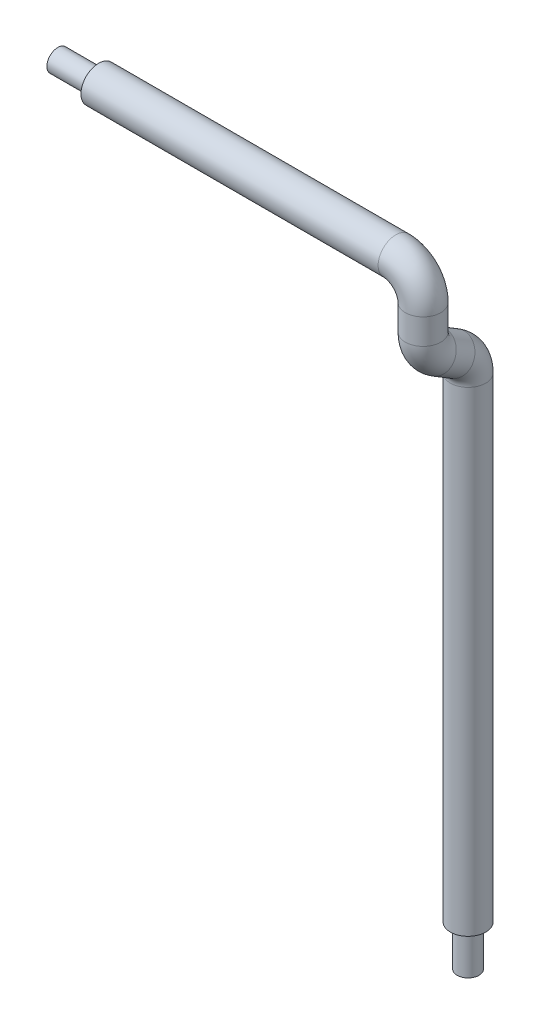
ISO-10303-21;
HEADER;
FILE_DESCRIPTION(('STEP AP214'),'2;1');
FILE_NAME('part.step','',(''),(''),'','','');
FILE_SCHEMA(('AUTOMOTIVE_DESIGN { 1 0 10303 214 1 1 1 1 }'));
ENDSEC;
DATA;
#1=APPLICATION_CONTEXT('core data for automotive mechanical design processes');
#2=APPLICATION_PROTOCOL_DEFINITION('international standard','automotive_design',2000,#1);
#3=PRODUCT_CONTEXT('',#1,'mechanical');
#4=PRODUCT('Part','Part','',(#3));
#5=PRODUCT_RELATED_PRODUCT_CATEGORY('part','',(#4));
#6=PRODUCT_DEFINITION_FORMATION('','',#4);
#7=PRODUCT_DEFINITION_CONTEXT('part definition',#1,'design');
#8=PRODUCT_DEFINITION('design','',#6,#7);
#9=PRODUCT_DEFINITION_SHAPE('','',#8);
#10=(LENGTH_UNIT() NAMED_UNIT(*) SI_UNIT(.MILLI.,.METRE.));
#11=(NAMED_UNIT(*) PLANE_ANGLE_UNIT() SI_UNIT($,.RADIAN.));
#12=(NAMED_UNIT(*) SI_UNIT($,.STERADIAN.) SOLID_ANGLE_UNIT());
#13=UNCERTAINTY_MEASURE_WITH_UNIT(LENGTH_MEASURE(1.E-05),#10,'distance_accuracy_value','');
#14=(GEOMETRIC_REPRESENTATION_CONTEXT(3) GLOBAL_UNCERTAINTY_ASSIGNED_CONTEXT((#13)) GLOBAL_UNIT_ASSIGNED_CONTEXT((#10,
#11,#12)) REPRESENTATION_CONTEXT('',''));
#15=CARTESIAN_POINT('',(0.,0.,0.));
#16=DIRECTION('',(0.,0.,1.));
#17=DIRECTION('',(1.,0.,0.));
#18=AXIS2_PLACEMENT_3D('',#15,#16,#17);
#19=CARTESIAN_POINT('',(-8.,-8.,-17.25));
#20=DIRECTION('',(1.,0.,0.));
#21=DIRECTION('',(0.,0.,-1.));
#22=AXIS2_PLACEMENT_3D('',#19,#20,#21);
#23=PLANE('',#22);
#24=CARTESIAN_POINT('',(-8.,-8.,-17.25));
#25=DIRECTION('',(-1.,0.,0.));
#26=DIRECTION('',(0.,0.,1.));
#27=AXIS2_PLACEMENT_3D('',#24,#25,#26);
#28=CIRCLE('',#27,0.4);
#29=CARTESIAN_POINT('',(-8.,-8.,-16.85));
#30=VERTEX_POINT('',#29);
#31=EDGE_CURVE('E18',#30,#30,#28,.F.);
#32=ORIENTED_EDGE('',*,*,#31,.F.);
#33=EDGE_LOOP('',(#32));
#34=FACE_BOUND('',#33,.T.);
#35=ADVANCED_FACE('F15',(#34),#23,.F.);
#36=CARTESIAN_POINT('',(-8.,-8.,-17.25));
#37=DIRECTION('',(-1.,0.,0.));
#38=DIRECTION('',(0.,0.,1.));
#39=AXIS2_PLACEMENT_3D('',#36,#37,#38);
#40=CYLINDRICAL_SURFACE('',#39,0.4);
#41=CARTESIAN_POINT('',(-6.5,-8.,-17.25));
#42=DIRECTION('',(-1.,0.,0.));
#43=DIRECTION('',(0.,0.,1.));
#44=AXIS2_PLACEMENT_3D('',#41,#42,#43);
#45=CIRCLE('',#44,0.4);
#46=CARTESIAN_POINT('',(-6.5,-8.,-16.85));
#47=VERTEX_POINT('',#46);
#48=EDGE_CURVE('E43',#47,#47,#45,.F.);
#49=ORIENTED_EDGE('',*,*,#48,.F.);
#50=EDGE_LOOP('',(#49));
#51=FACE_BOUND('',#50,.T.);
#52=ORIENTED_EDGE('',*,*,#31,.T.);
#53=EDGE_LOOP('',(#52));
#54=FACE_BOUND('',#53,.T.);
#55=ADVANCED_FACE('F50',(#51,#54),#40,.T.);
#56=CARTESIAN_POINT('',(-6.5,0.,0.));
#57=DIRECTION('',(-1.,0.,0.));
#58=DIRECTION('',(0.,0.,1.));
#59=AXIS2_PLACEMENT_3D('',#56,#57,#58);
#60=PLANE('',#59);
#61=ORIENTED_EDGE('',*,*,#48,.T.);
#62=EDGE_LOOP('',(#61));
#63=FACE_BOUND('',#62,.T.);
#64=CARTESIAN_POINT('',(-6.5,-8.,-17.25));
#65=DIRECTION('',(1.,0.,0.));
#66=DIRECTION('',(0.,0.,-1.));
#67=AXIS2_PLACEMENT_3D('',#64,#65,#66);
#68=CIRCLE('',#67,0.65);
#69=CARTESIAN_POINT('',(-6.5,-8.,-17.9));
#70=VERTEX_POINT('',#69);
#71=EDGE_CURVE('E40',#70,#70,#68,.T.);
#72=ORIENTED_EDGE('',*,*,#71,.F.);
#73=EDGE_LOOP('',(#72));
#74=FACE_BOUND('',#73,.T.);
#75=ADVANCED_FACE('F57',(#63,#74),#60,.T.);
#76=CARTESIAN_POINT('',(-8.,-8.,-17.25));
#77=DIRECTION('',(1.,0.,0.));
#78=DIRECTION('',(0.,0.,-1.));
#79=AXIS2_PLACEMENT_3D('',#76,#77,#78);
#80=CYLINDRICAL_SURFACE('',#79,0.65);
#81=CARTESIAN_POINT('',(4.4,-8.,-17.25));
#82=DIRECTION('',(1.,0.,0.));
#83=DIRECTION('',(0.,1.,0.));
#84=AXIS2_PLACEMENT_3D('',#81,#82,#83);
#85=CIRCLE('',#84,0.65);
#86=CARTESIAN_POINT('',(4.4,-7.35,-17.25));
#87=VERTEX_POINT('',#86);
#88=EDGE_CURVE('E42',#87,#87,#85,.T.);
#89=ORIENTED_EDGE('',*,*,#88,.F.);
#90=EDGE_LOOP('',(#89));
#91=FACE_BOUND('',#90,.T.);
#92=ORIENTED_EDGE('',*,*,#71,.T.);
#93=EDGE_LOOP('',(#92));
#94=FACE_BOUND('',#93,.T.);
#95=ADVANCED_FACE('F99',(#91,#94),#80,.T.);
#96=CARTESIAN_POINT('',(4.4,-9.,-17.25));
#97=DIRECTION('',(0.,0.,-1.));
#98=DIRECTION('',(0.,-1.,0.));
#99=AXIS2_PLACEMENT_3D('',#96,#97,#98);
#100=TOROIDAL_SURFACE('',#99,1.,0.65);
#101=CARTESIAN_POINT('',(5.4,-9.,-17.25));
#102=DIRECTION('',(0.,-1.,0.));
#103=DIRECTION('',(0.,0.,-1.));
#104=AXIS2_PLACEMENT_3D('',#101,#102,#103);
#105=CIRCLE('',#104,0.65);
#106=CARTESIAN_POINT('',(5.4,-9.,-17.9));
#107=VERTEX_POINT('',#106);
#108=EDGE_CURVE('E31',#107,#107,#105,.T.);
#109=ORIENTED_EDGE('',*,*,#108,.F.);
#110=EDGE_LOOP('',(#109));
#111=FACE_BOUND('',#110,.T.);
#112=ORIENTED_EDGE('',*,*,#88,.T.);
#113=EDGE_LOOP('',(#112));
#114=FACE_BOUND('',#113,.T.);
#115=ADVANCED_FACE('F94',(#111,#114),#100,.T.);
#116=CARTESIAN_POINT('',(5.4,-9.,-17.25));
#117=DIRECTION('',(0.,-1.,0.));
#118=DIRECTION('',(0.,0.,-1.));
#119=AXIS2_PLACEMENT_3D('',#116,#117,#118);
#120=CYLINDRICAL_SURFACE('',#119,0.65);
#121=CARTESIAN_POINT('',(5.4,-9.936740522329,-17.25));
#122=DIRECTION('',(0.,-1.,0.));
#123=DIRECTION('',(0.,0.,1.));
#124=AXIS2_PLACEMENT_3D('',#121,#122,#123);
#125=CIRCLE('',#124,0.65);
#126=CARTESIAN_POINT('',(5.4,-9.936740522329,-16.6));
#127=VERTEX_POINT('',#126);
#128=EDGE_CURVE('E103',#127,#127,#125,.T.);
#129=ORIENTED_EDGE('',*,*,#128,.F.);
#130=EDGE_LOOP('',(#129));
#131=FACE_BOUND('',#130,.T.);
#132=ORIENTED_EDGE('',*,*,#108,.T.);
#133=EDGE_LOOP('',(#132));
#134=FACE_BOUND('',#133,.T.);
#135=ADVANCED_FACE('F90',(#131,#134),#120,.T.);
#136=CARTESIAN_POINT('',(5.4,-9.936740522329,-18.25));
#137=DIRECTION('',(1.,0.,0.));
#138=DIRECTION('',(0.,0.,-1.));
#139=AXIS2_PLACEMENT_3D('',#136,#137,#138);
#140=TOROIDAL_SURFACE('',#139,1.,0.65);
#141=CARTESIAN_POINT('',(5.4,-10.7919383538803,-17.7316982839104));
#142=DIRECTION('',(0.,-0.51830171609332,-0.855197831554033));
#143=DIRECTION('',(0.,0.855197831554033,-0.51830171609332));
#144=AXIS2_PLACEMENT_3D('',#141,#142,#143);
#145=CIRCLE('',#144,0.65);
#146=CARTESIAN_POINT('',(5.4,-10.2360597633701,-18.0685943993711));
#147=VERTEX_POINT('',#146);
#148=EDGE_CURVE('E39',#147,#147,#145,.T.);
#149=ORIENTED_EDGE('',*,*,#148,.F.);
#150=EDGE_LOOP('',(#149));
#151=FACE_BOUND('',#150,.T.);
#152=ORIENTED_EDGE('',*,*,#128,.T.);
#153=EDGE_LOOP('',(#152));
#154=FACE_BOUND('',#153,.T.);
#155=ADVANCED_FACE('F85',(#151,#154),#140,.T.);
#156=CARTESIAN_POINT('',(5.4,-31.,-18.9));
#157=DIRECTION('',(0.,-1.,0.));
#158=DIRECTION('',(0.,0.,-1.));
#159=AXIS2_PLACEMENT_3D('',#156,#157,#158);
#160=PLANE('',#159);
#161=CARTESIAN_POINT('',(5.4,-31.,-18.9));
#162=DIRECTION('',(0.,-1.,0.));
#163=DIRECTION('',(0.,0.,-1.));
#164=AXIS2_PLACEMENT_3D('',#161,#162,#163);
#165=CIRCLE('',#164,0.4);
#166=CARTESIAN_POINT('',(5.4,-31.,-19.3));
#167=VERTEX_POINT('',#166);
#168=EDGE_CURVE('E36',#167,#167,#165,.F.);
#169=ORIENTED_EDGE('',*,*,#168,.F.);
#170=EDGE_LOOP('',(#169));
#171=FACE_BOUND('',#170,.T.);
#172=ADVANCED_FACE('F89',(#171),#160,.T.);
#173=CARTESIAN_POINT('',(5.4,-10.79193835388,-17.73169828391));
#174=DIRECTION('',(0.,-0.51830171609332,-0.855197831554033));
#175=DIRECTION('',(0.,0.855197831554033,-0.51830171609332));
#176=AXIS2_PLACEMENT_3D('',#173,#174,#175);
#177=CYLINDRICAL_SURFACE('',#176,0.65);
#178=CARTESIAN_POINT('',(5.4,-11.2080616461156,-18.4183017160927));
#179=DIRECTION('',(0.,-0.518301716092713,-0.8551978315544));
#180=DIRECTION('',(0.,0.8551978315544,-0.518301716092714));
#181=AXIS2_PLACEMENT_3D('',#178,#179,#180);
#182=CIRCLE('',#181,0.65);
#183=CARTESIAN_POINT('',(5.4,-10.6521830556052,-18.755197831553));
#184=VERTEX_POINT('',#183);
#185=EDGE_CURVE('E35',#184,#184,#182,.T.);
#186=ORIENTED_EDGE('',*,*,#185,.F.);
#187=EDGE_LOOP('',(#186));
#188=FACE_BOUND('',#187,.T.);
#189=ORIENTED_EDGE('',*,*,#148,.T.);
#190=EDGE_LOOP('',(#189));
#191=FACE_BOUND('',#190,.T.);
#192=ADVANCED_FACE('F116',(#188,#191),#177,.T.);
#193=CARTESIAN_POINT('',(5.4,-21.,-18.9));
#194=DIRECTION('',(0.,-1.,0.));
#195=DIRECTION('',(0.,0.,-1.));
#196=AXIS2_PLACEMENT_3D('',#193,#194,#195);
#197=CYLINDRICAL_SURFACE('',#196,0.4);
#198=CARTESIAN_POINT('',(5.4,-29.5,-18.9));
#199=DIRECTION('',(0.,-1.,0.));
#200=DIRECTION('',(0.,0.,-1.));
#201=AXIS2_PLACEMENT_3D('',#198,#199,#200);
#202=CIRCLE('',#201,0.4);
#203=CARTESIAN_POINT('',(5.4,-29.5,-19.3));
#204=VERTEX_POINT('',#203);
#205=EDGE_CURVE('E27',#204,#204,#202,.F.);
#206=ORIENTED_EDGE('',*,*,#205,.F.);
#207=EDGE_LOOP('',(#206));
#208=FACE_BOUND('',#207,.T.);
#209=ORIENTED_EDGE('',*,*,#168,.T.);
#210=EDGE_LOOP('',(#209));
#211=FACE_BOUND('',#210,.T.);
#212=ADVANCED_FACE('F74',(#208,#211),#197,.T.);
#213=CARTESIAN_POINT('',(5.4,-12.06325947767,-17.9));
#214=DIRECTION('',(-1.,0.,0.));
#215=DIRECTION('',(0.,-0.855197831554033,0.518301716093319));
#216=AXIS2_PLACEMENT_3D('',#213,#214,#215);
#217=TOROIDAL_SURFACE('',#216,0.999999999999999,0.65);
#218=CARTESIAN_POINT('',(5.4,-12.06325947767,-18.9));
#219=DIRECTION('',(0.,-1.,0.));
#220=DIRECTION('',(0.,0.,-1.));
#221=AXIS2_PLACEMENT_3D('',#218,#219,#220);
#222=CIRCLE('',#221,0.65);
#223=CARTESIAN_POINT('',(5.4,-12.06325947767,-19.55));
#224=VERTEX_POINT('',#223);
#225=EDGE_CURVE('E22',#224,#224,#222,.T.);
#226=ORIENTED_EDGE('',*,*,#225,.F.);
#227=EDGE_LOOP('',(#226));
#228=FACE_BOUND('',#227,.T.);
#229=ORIENTED_EDGE('',*,*,#185,.T.);
#230=EDGE_LOOP('',(#229));
#231=FACE_BOUND('',#230,.T.);
#232=ADVANCED_FACE('F67',(#228,#231),#217,.T.);
#233=CARTESIAN_POINT('',(0.,-29.5,0.));
#234=DIRECTION('',(0.,-1.,0.));
#235=DIRECTION('',(0.,0.,-1.));
#236=AXIS2_PLACEMENT_3D('',#233,#234,#235);
#237=PLANE('',#236);
#238=ORIENTED_EDGE('',*,*,#205,.T.);
#239=EDGE_LOOP('',(#238));
#240=FACE_BOUND('',#239,.T.);
#241=CARTESIAN_POINT('',(5.4,-29.5,-18.9));
#242=DIRECTION('',(0.,-1.,0.));
#243=DIRECTION('',(0.,0.,-1.));
#244=AXIS2_PLACEMENT_3D('',#241,#242,#243);
#245=CIRCLE('',#244,0.65);
#246=CARTESIAN_POINT('',(5.4,-29.5,-19.55));
#247=VERTEX_POINT('',#246);
#248=EDGE_CURVE('E10',#247,#247,#245,.F.);
#249=ORIENTED_EDGE('',*,*,#248,.F.);
#250=EDGE_LOOP('',(#249));
#251=FACE_BOUND('',#250,.T.);
#252=ADVANCED_FACE('F61',(#240,#251),#237,.T.);
#253=CARTESIAN_POINT('',(5.4,-12.06325947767,-18.9));
#254=DIRECTION('',(0.,-1.,0.));
#255=DIRECTION('',(0.,0.,-1.));
#256=AXIS2_PLACEMENT_3D('',#253,#254,#255);
#257=CYLINDRICAL_SURFACE('',#256,0.65);
#258=ORIENTED_EDGE('',*,*,#225,.T.);
#259=EDGE_LOOP('',(#258));
#260=FACE_BOUND('',#259,.T.);
#261=ORIENTED_EDGE('',*,*,#248,.T.);
#262=EDGE_LOOP('',(#261));
#263=FACE_BOUND('',#262,.T.);
#264=ADVANCED_FACE('F59',(#260,#263),#257,.T.);
#265=CLOSED_SHELL('',(#35,#55,#75,#95,#115,#135,#155,#172,#192,#212,#232,#252,#264));
#266=MANIFOLD_SOLID_BREP('B1',#265);
#267=ADVANCED_BREP_SHAPE_REPRESENTATION('',(#18,#266),#14);
#268=SHAPE_DEFINITION_REPRESENTATION(#9,#267);
ENDSEC;
END-ISO-10303-21;
